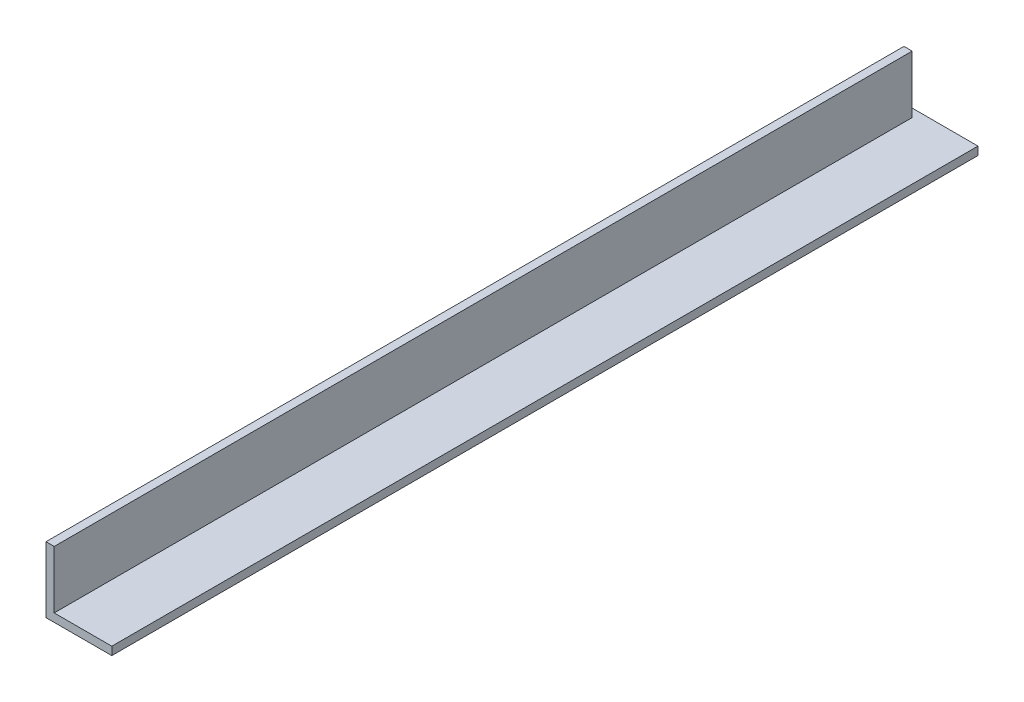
from build123d import *

# Parameters (mm, degrees)
BOSS_EXTRUDE1_DEPTH = 501.65
CUT_EXTRUDE1_REACH  = 506.535
SKETCH2_W           = 4.7752
SKETCH2_H           = 33.3502


with BuildPart() as part:
    # Sketch1 → Boss-Extrude1 (new body)
    with BuildSketch(Plane.XY):
        Polygon((0, 0), (0, 38.1), (4.7498, 38.1), (4.7498, 4.7498), (38.1, 4.7498), (38.1, 0), align=None)
    extrude(amount=BOSS_EXTRUDE1_DEPTH)

    # Sketch2 → Cut-Extrude1 (cut, up to next)
    with BuildSketch(Plane.ZY, mode=Mode.PRIVATE) as cut_extrude1_sk1:
        with Locations((2.3876, 21.4249)):
            Rectangle(SKETCH2_W, SKETCH2_H)
    cut_extrude1_tool1 = extrude(cut_extrude1_sk1.sketch, amount=-CUT_EXTRUDE1_REACH, mode=Mode.PRIVATE) & part.part
    add(cut_extrude1_tool1.solids().sort_by_distance((0, 21.4249, 2.3876))[0], mode=Mode.SUBTRACT)


solid = part.part
